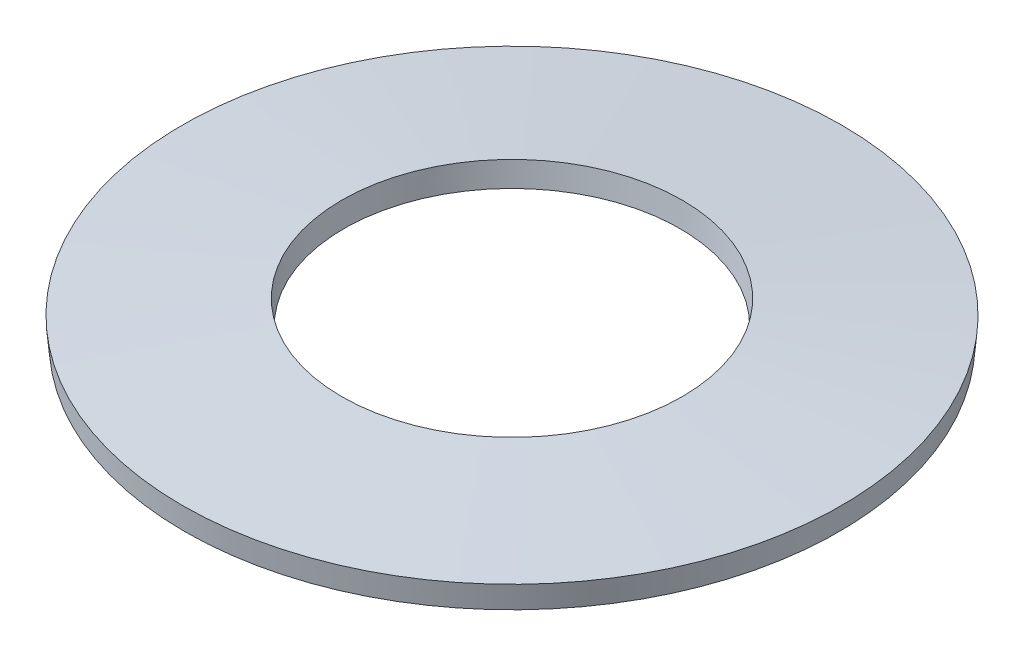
ISO-10303-21;
HEADER;
FILE_DESCRIPTION(('STEP AP214'),'2;1');
FILE_NAME('part.step','',(''),(''),'','','');
FILE_SCHEMA(('AUTOMOTIVE_DESIGN { 1 0 10303 214 1 1 1 1 }'));
ENDSEC;
DATA;
#1=APPLICATION_CONTEXT('core data for automotive mechanical design processes');
#2=APPLICATION_PROTOCOL_DEFINITION('international standard','automotive_design',2000,#1);
#3=PRODUCT_CONTEXT('',#1,'mechanical');
#4=PRODUCT('Part','Part','',(#3));
#5=PRODUCT_RELATED_PRODUCT_CATEGORY('part','',(#4));
#6=PRODUCT_DEFINITION_FORMATION('','',#4);
#7=PRODUCT_DEFINITION_CONTEXT('part definition',#1,'design');
#8=PRODUCT_DEFINITION('design','',#6,#7);
#9=PRODUCT_DEFINITION_SHAPE('','',#8);
#10=(LENGTH_UNIT() NAMED_UNIT(*) SI_UNIT(.MILLI.,.METRE.));
#11=(NAMED_UNIT(*) PLANE_ANGLE_UNIT() SI_UNIT($,.RADIAN.));
#12=(NAMED_UNIT(*) SI_UNIT($,.STERADIAN.) SOLID_ANGLE_UNIT());
#13=UNCERTAINTY_MEASURE_WITH_UNIT(LENGTH_MEASURE(1.E-05),#10,'distance_accuracy_value','');
#14=(GEOMETRIC_REPRESENTATION_CONTEXT(3) GLOBAL_UNCERTAINTY_ASSIGNED_CONTEXT((#13)) GLOBAL_UNIT_ASSIGNED_CONTEXT((#10,
#11,#12)) REPRESENTATION_CONTEXT('',''));
#15=CARTESIAN_POINT('',(0.,0.,0.));
#16=DIRECTION('',(0.,0.,1.));
#17=DIRECTION('',(1.,0.,0.));
#18=AXIS2_PLACEMENT_3D('',#15,#16,#17);
#19=CARTESIAN_POINT('',(0.,0.,0.));
#20=DIRECTION('',(0.,1.,0.));
#21=DIRECTION('',(0.,0.,1.00000000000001));
#22=AXIS2_PLACEMENT_3D('',#19,#20,#21);
#23=CONICAL_SURFACE('',#22,3.28022198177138,0.0913825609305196);
#24=CARTESIAN_POINT('',(0.,-0.455292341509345,0.));
#25=DIRECTION('',(0.,1.,0.));
#26=DIRECTION('',(0.,0.,1.00000000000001));
#27=AXIS2_PLACEMENT_3D('',#24,#25,#26);
#28=CIRCLE('',#27,3.2385);
#29=CARTESIAN_POINT('',(0.,-0.455292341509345,3.23850000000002));
#30=VERTEX_POINT('',#29);
#31=EDGE_CURVE('E10',#30,#30,#28,.T.);
#32=ORIENTED_EDGE('',*,*,#31,.F.);
#33=EDGE_LOOP('',(#32));
#34=FACE_BOUND('',#33,.T.);
#35=CARTESIAN_POINT('',(0.,0.,0.));
#36=DIRECTION('',(0.,1.,0.));
#37=DIRECTION('',(0.,0.,1.00000000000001));
#38=AXIS2_PLACEMENT_3D('',#35,#36,#37);
#39=CIRCLE('',#38,3.28022198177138);
#40=CARTESIAN_POINT('',(0.,0.,3.2802219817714));
#41=VERTEX_POINT('',#40);
#42=EDGE_CURVE('E44',#41,#41,#39,.T.);
#43=ORIENTED_EDGE('',*,*,#42,.T.);
#44=EDGE_LOOP('',(#43));
#45=FACE_BOUND('',#44,.T.);
#46=ADVANCED_FACE('F30',(#34,#45),#23,.F.);
#47=CARTESIAN_POINT('',(0.,-0.455292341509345,0.));
#48=DIRECTION('',(0.,-1.,0.));
#49=DIRECTION('',(0.,0.,-1.00000000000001));
#50=AXIS2_PLACEMENT_3D('',#47,#48,#49);
#51=CONICAL_SURFACE('',#50,3.2385,1.47941376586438);
#52=CARTESIAN_POINT('',(0.,-0.736599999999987,0.));
#53=DIRECTION('',(0.,1.,0.));
#54=DIRECTION('',(0.,0.,1.00000000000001));
#55=AXIS2_PLACEMENT_3D('',#52,#53,#54);
#56=CIRCLE('',#55,6.30827801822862);
#57=CARTESIAN_POINT('',(0.,-0.736599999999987,6.30827801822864));
#58=VERTEX_POINT('',#57);
#59=EDGE_CURVE('E36',#58,#58,#56,.T.);
#60=ORIENTED_EDGE('',*,*,#59,.F.);
#61=EDGE_LOOP('',(#60));
#62=FACE_BOUND('',#61,.T.);
#63=ORIENTED_EDGE('',*,*,#31,.T.);
#64=EDGE_LOOP('',(#63));
#65=FACE_BOUND('',#64,.T.);
#66=ADVANCED_FACE('F59',(#62,#65),#51,.F.);
#67=CARTESIAN_POINT('',(0.,-0.736599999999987,0.));
#68=DIRECTION('',(0.,1.,0.));
#69=DIRECTION('',(0.,0.,1.00000000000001));
#70=AXIS2_PLACEMENT_3D('',#67,#68,#69);
#71=CONICAL_SURFACE('',#70,6.30827801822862,0.0913825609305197);
#72=CARTESIAN_POINT('',(0.,-0.281307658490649,0.));
#73=DIRECTION('',(0.,1.,0.));
#74=DIRECTION('',(0.,0.,1.00000000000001));
#75=AXIS2_PLACEMENT_3D('',#72,#73,#74);
#76=CIRCLE('',#75,6.35);
#77=CARTESIAN_POINT('',(0.,-0.281307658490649,6.35000000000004));
#78=VERTEX_POINT('',#77);
#79=EDGE_CURVE('E40',#78,#78,#76,.T.);
#80=ORIENTED_EDGE('',*,*,#79,.F.);
#81=EDGE_LOOP('',(#80));
#82=FACE_BOUND('',#81,.T.);
#83=ORIENTED_EDGE('',*,*,#59,.T.);
#84=EDGE_LOOP('',(#83));
#85=FACE_BOUND('',#84,.T.);
#86=ADVANCED_FACE('F54',(#82,#85),#71,.T.);
#87=CARTESIAN_POINT('',(0.,-0.281307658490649,0.));
#88=DIRECTION('',(0.,-1.,0.));
#89=DIRECTION('',(0.,0.,-1.00000000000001));
#90=AXIS2_PLACEMENT_3D('',#87,#88,#89);
#91=CONICAL_SURFACE('',#90,6.35,1.47941376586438);
#92=ORIENTED_EDGE('',*,*,#42,.F.);
#93=EDGE_LOOP('',(#92));
#94=FACE_BOUND('',#93,.T.);
#95=ORIENTED_EDGE('',*,*,#79,.T.);
#96=EDGE_LOOP('',(#95));
#97=FACE_BOUND('',#96,.T.);
#98=ADVANCED_FACE('F51',(#94,#97),#91,.T.);
#99=CLOSED_SHELL('',(#46,#66,#86,#98));
#100=MANIFOLD_SOLID_BREP('B2',#99);
#101=ADVANCED_BREP_SHAPE_REPRESENTATION('',(#18,#100),#14);
#102=SHAPE_DEFINITION_REPRESENTATION(#9,#101);
ENDSEC;
END-ISO-10303-21;
